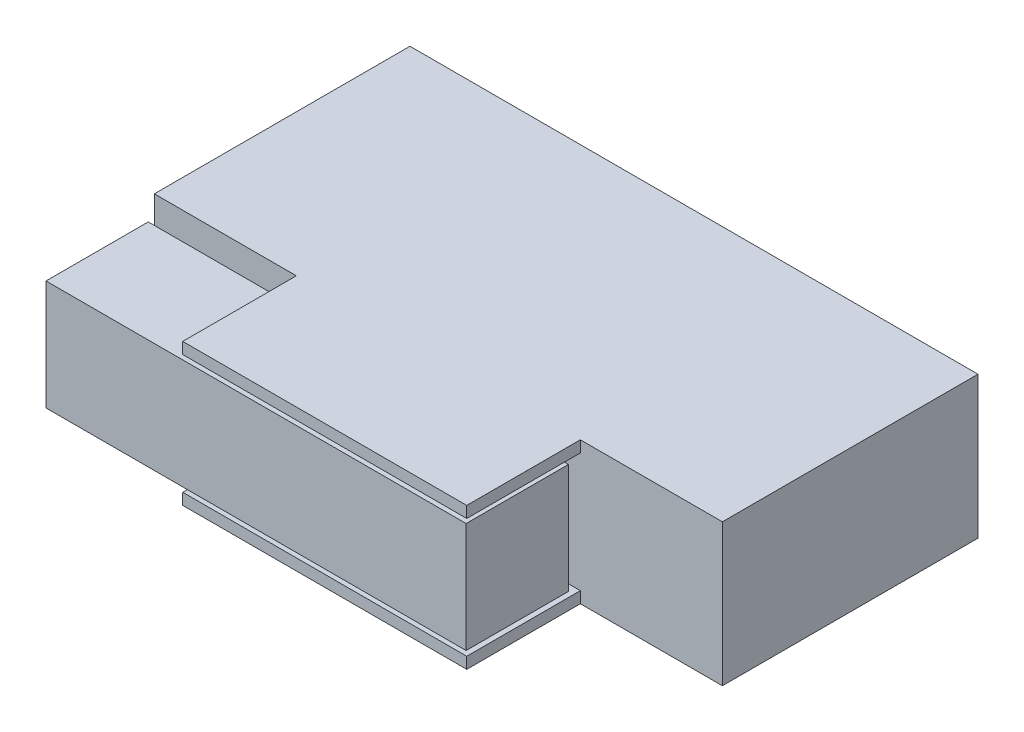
from build123d import *

# Parameters (mm, degrees)
ESQUISSE1_W      = 10
ESQUISSE1_H      = 2.5
EXTRUSION1_DEPTH = 6.5
EXTRUSION2_DEPTH = 2
ESQUISSE3_W      = 7.395820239
ESQUISSE3_H      = 1.93647956
EXTRUSION3_DEPTH = 1.8


with BuildPart() as part:
    # Esquisse1 → Extrusion1 (new body)
    with BuildSketch(Plane.XY):
        with Locations((5, 1.25)):
            Rectangle(ESQUISSE1_W, ESQUISSE1_H)
    extrude(amount=EXTRUSION1_DEPTH)

    # Esquisse2 → Extrusion2 (cut)
    with BuildSketch(Plane.XY.offset(6.5)):
        Polygon((2.5, 2.3), (7.5, 2.3), (7.5, 2.5), (10, 2.5), (10, 0), (7.5, 0), (7.5, 0.2), (2.5, 0.2), (2.5, 0), (0, 0), (0, 2.5), (2.5, 2.5), align=None)
    extrude(amount=-EXTRUSION2_DEPTH, mode=Mode.SUBTRACT)


with BuildPart() as body_2:
    # Esquisse3 → Extrusion3 (new body)
    with BuildSketch(Plane.XY.offset(6.5)):
        with Locations((3.791067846, 1.25)):
            Rectangle(ESQUISSE3_W, ESQUISSE3_H)
    extrude(amount=-EXTRUSION3_DEPTH)


solid = Compound([part.part, body_2.part])
